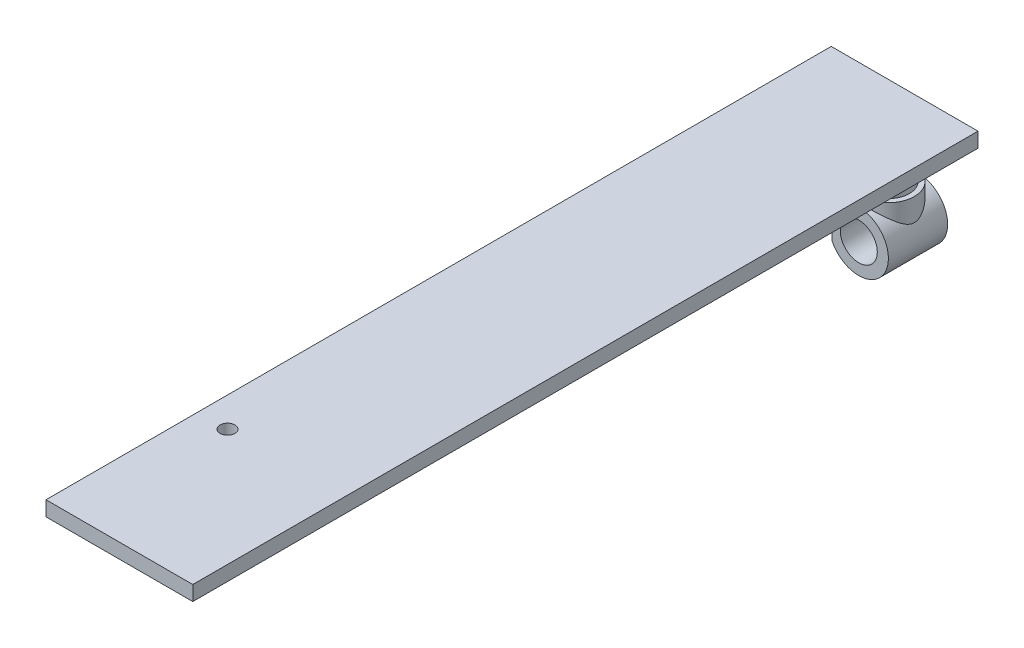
ISO-10303-21;
HEADER;
FILE_DESCRIPTION(('STEP AP214'),'2;1');
FILE_NAME('part.step','',(''),(''),'','','');
FILE_SCHEMA(('AUTOMOTIVE_DESIGN { 1 0 10303 214 1 1 1 1 }'));
ENDSEC;
DATA;
#1=APPLICATION_CONTEXT('core data for automotive mechanical design processes');
#2=APPLICATION_PROTOCOL_DEFINITION('international standard','automotive_design',2000,#1);
#3=PRODUCT_CONTEXT('',#1,'mechanical');
#4=PRODUCT('Part','Part','',(#3));
#5=PRODUCT_RELATED_PRODUCT_CATEGORY('part','',(#4));
#6=PRODUCT_DEFINITION_FORMATION('','',#4);
#7=PRODUCT_DEFINITION_CONTEXT('part definition',#1,'design');
#8=PRODUCT_DEFINITION('design','',#6,#7);
#9=PRODUCT_DEFINITION_SHAPE('','',#8);
#10=(LENGTH_UNIT() NAMED_UNIT(*) SI_UNIT(.MILLI.,.METRE.));
#11=(NAMED_UNIT(*) PLANE_ANGLE_UNIT() SI_UNIT($,.RADIAN.));
#12=(NAMED_UNIT(*) SI_UNIT($,.STERADIAN.) SOLID_ANGLE_UNIT());
#13=UNCERTAINTY_MEASURE_WITH_UNIT(LENGTH_MEASURE(1.E-05),#10,'distance_accuracy_value','');
#14=(GEOMETRIC_REPRESENTATION_CONTEXT(3) GLOBAL_UNCERTAINTY_ASSIGNED_CONTEXT((#13)) GLOBAL_UNIT_ASSIGNED_CONTEXT((#10,
#11,#12)) REPRESENTATION_CONTEXT('',''));
#15=CARTESIAN_POINT('',(0.,0.,0.));
#16=DIRECTION('',(0.,0.,1.));
#17=DIRECTION('',(1.,0.,0.));
#18=AXIS2_PLACEMENT_3D('',#15,#16,#17);
#19=CARTESIAN_POINT('',(0.,0.,20.));
#20=DIRECTION('',(0.,0.,1.));
#21=DIRECTION('',(1.,0.,0.));
#22=AXIS2_PLACEMENT_3D('',#19,#20,#21);
#23=PLANE('',#22);
#24=DIRECTION('',(0.,1.,0.));
#25=VECTOR('',#24,1.);
#26=CARTESIAN_POINT('',(-18.,10.,20.));
#27=LINE('',#26,#25);
#28=CARTESIAN_POINT('',(-18.,-8.71779788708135,20.));
#29=VERTEX_POINT('',#28);
#30=CARTESIAN_POINT('',(-18.,8.71779788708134,20.));
#31=VERTEX_POINT('',#30);
#32=EDGE_CURVE('E47',#29,#31,#27,.T.);
#33=ORIENTED_EDGE('',*,*,#32,.F.);
#34=CARTESIAN_POINT('',(0.,0.,20.));
#35=DIRECTION('',(0.,0.,1.));
#36=DIRECTION('',(1.,0.,0.));
#37=AXIS2_PLACEMENT_3D('',#34,#35,#36);
#38=CIRCLE('',#37,20.);
#39=EDGE_CURVE('E309',#29,#31,#38,.T.);
#40=ORIENTED_EDGE('',*,*,#39,.T.);
#41=EDGE_LOOP('',(#33,#40));
#42=FACE_BOUND('',#41,.T.);
#43=CARTESIAN_POINT('',(0.,0.,20.));
#44=DIRECTION('',(0.,0.,1.));
#45=DIRECTION('',(1.,0.,0.));
#46=AXIS2_PLACEMENT_3D('',#43,#44,#45);
#47=CIRCLE('',#46,12.5);
#48=CARTESIAN_POINT('',(12.5,0.,20.));
#49=VERTEX_POINT('',#48);
#50=EDGE_CURVE('E145',#49,#49,#47,.T.);
#51=ORIENTED_EDGE('',*,*,#50,.F.);
#52=EDGE_LOOP('',(#51));
#53=FACE_BOUND('',#52,.T.);
#54=ADVANCED_FACE('F32',(#42,#53),#23,.T.);
#55=CARTESIAN_POINT('',(0.,0.,-20.));
#56=DIRECTION('',(0.,0.,1.));
#57=DIRECTION('',(1.,0.,0.));
#58=AXIS2_PLACEMENT_3D('',#55,#56,#57);
#59=PLANE('',#58);
#60=CARTESIAN_POINT('',(0.,0.,-20.));
#61=DIRECTION('',(0.,0.,1.));
#62=DIRECTION('',(1.,0.,0.));
#63=AXIS2_PLACEMENT_3D('',#60,#61,#62);
#64=CIRCLE('',#63,20.);
#65=CARTESIAN_POINT('',(-18.,-8.71779788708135,-20.));
#66=VERTEX_POINT('',#65);
#67=CARTESIAN_POINT('',(-18.,8.71779788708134,-20.));
#68=VERTEX_POINT('',#67);
#69=EDGE_CURVE('E313',#66,#68,#64,.T.);
#70=ORIENTED_EDGE('',*,*,#69,.F.);
#71=DIRECTION('',(0.,1.,0.));
#72=VECTOR('',#71,1.);
#73=CARTESIAN_POINT('',(-18.,10.,-20.));
#74=LINE('',#73,#72);
#75=EDGE_CURVE('E131',#66,#68,#74,.T.);
#76=ORIENTED_EDGE('',*,*,#75,.T.);
#77=EDGE_LOOP('',(#70,#76));
#78=FACE_BOUND('',#77,.T.);
#79=CARTESIAN_POINT('',(0.,0.,-20.));
#80=DIRECTION('',(0.,0.,1.));
#81=DIRECTION('',(1.,0.,0.));
#82=AXIS2_PLACEMENT_3D('',#79,#80,#81);
#83=CIRCLE('',#82,12.5);
#84=CARTESIAN_POINT('',(12.5,0.,-20.));
#85=VERTEX_POINT('',#84);
#86=EDGE_CURVE('E144',#85,#85,#83,.T.);
#87=ORIENTED_EDGE('',*,*,#86,.T.);
#88=EDGE_LOOP('',(#87));
#89=FACE_BOUND('',#88,.T.);
#90=ADVANCED_FACE('F185',(#78,#89),#59,.F.);
#91=CARTESIAN_POINT('',(0.,0.,20.));
#92=DIRECTION('',(0.,0.,-1.));
#93=DIRECTION('',(-1.,0.,0.));
#94=AXIS2_PLACEMENT_3D('',#91,#92,#93);
#95=CYLINDRICAL_SURFACE('',#94,20.);
#96=CARTESIAN_POINT('',(0.,20.,17.5));
#97=CARTESIAN_POINT('',(0.409310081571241,20.0000043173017,17.5000043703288));
#98=CARTESIAN_POINT('',(0.81857181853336,19.9874130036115,17.4856188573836));
#99=CARTESIAN_POINT('',(1.63371360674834,19.9373449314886,17.428365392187));
#100=CARTESIAN_POINT('',(2.03959248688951,19.8998598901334,17.3854879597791));
#101=CARTESIAN_POINT('',(2.84495519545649,19.8007848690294,17.271995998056));
#102=CARTESIAN_POINT('',(3.24443051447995,19.739165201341,17.2013473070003));
#103=CARTESIAN_POINT('',(4.03348452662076,19.5931618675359,17.0336049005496));
#104=CARTESIAN_POINT('',(4.42306380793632,19.5087795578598,16.9365127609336));
#105=CARTESIAN_POINT('',(5.18734779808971,19.3195605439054,16.7182045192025));
#106=CARTESIAN_POINT('',(5.5621332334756,19.2148614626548,16.5971506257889));
#107=CARTESIAN_POINT('',(6.29757814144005,18.9865422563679,16.3322776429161));
#108=CARTESIAN_POINT('',(6.6582377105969,18.8629222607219,16.188458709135));
#109=CARTESIAN_POINT('',(7.36399894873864,18.5987498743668,15.8798571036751));
#110=CARTESIAN_POINT('',(7.70910095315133,18.4581978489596,15.715074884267));
#111=CARTESIAN_POINT('',(8.38281370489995,18.1621555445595,15.3662745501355));
#112=CARTESIAN_POINT('',(8.71142079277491,18.0066619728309,15.1822521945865));
#113=CARTESIAN_POINT('',(9.47545139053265,17.6199703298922,14.721904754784));
#114=CARTESIAN_POINT('',(9.90295999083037,17.3827741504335,14.4374321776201));
#115=CARTESIAN_POINT('',(10.7241338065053,16.8885404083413,13.8384055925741));
#116=CARTESIAN_POINT('',(11.1177867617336,16.6314957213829,13.5238407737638));
#117=CARTESIAN_POINT('',(11.8718925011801,16.101891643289,12.8669653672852));
#118=CARTESIAN_POINT('',(12.2322661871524,15.8292976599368,12.5245921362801));
#119=CARTESIAN_POINT('',(12.9189520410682,15.2740176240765,11.8150097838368));
#120=CARTESIAN_POINT('',(13.245268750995,14.9913329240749,11.4478039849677));
#121=CARTESIAN_POINT('',(13.8709259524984,14.4146539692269,10.6816356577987));
#122=CARTESIAN_POINT('',(14.1695316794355,14.1205473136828,10.2821585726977));
#123=CARTESIAN_POINT('',(14.7319137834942,13.532778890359,9.45882545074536));
#124=CARTESIAN_POINT('',(14.9956791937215,13.2391172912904,9.03496179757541));
#125=CARTESIAN_POINT('',(15.4875688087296,12.6601412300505,8.16304947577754));
#126=CARTESIAN_POINT('',(15.7157616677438,12.3748115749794,7.7150496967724));
#127=CARTESIAN_POINT('',(16.1360267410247,11.8215430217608,6.79231309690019));
#128=CARTESIAN_POINT('',(16.3281264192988,11.5535910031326,6.31759696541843));
#129=CARTESIAN_POINT('',(16.5900333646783,11.171205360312,5.5760316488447));
#130=CARTESIAN_POINT('',(16.6739706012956,11.0453363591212,5.32001317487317));
#131=CARTESIAN_POINT('',(16.8311299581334,10.8043372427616,4.79968230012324));
#132=CARTESIAN_POINT('',(16.9043516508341,10.6892075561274,4.53536956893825));
#133=CARTESIAN_POINT('',(17.03927411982,10.4727930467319,3.99869568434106));
#134=CARTESIAN_POINT('',(17.1009917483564,10.37148803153,3.72634699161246));
#135=CARTESIAN_POINT('',(17.2121601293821,10.1859341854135,3.17347969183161));
#136=CARTESIAN_POINT('',(17.2616155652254,10.1016788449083,2.89296424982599));
#137=CARTESIAN_POINT('',(17.3407113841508,9.96518782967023,2.36830260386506));
#138=CARTESIAN_POINT('',(17.3722302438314,9.91001953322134,2.1252065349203));
#139=CARTESIAN_POINT('',(17.425218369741,9.81655062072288,1.63478947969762));
#140=CARTESIAN_POINT('',(17.4466926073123,9.77824166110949,1.3874706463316));
#141=CARTESIAN_POINT('',(17.4791148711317,9.7201678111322,0.890241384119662));
#142=CARTESIAN_POINT('',(17.4900749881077,9.70038162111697,0.64033426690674));
#143=CARTESIAN_POINT('',(17.5012364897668,9.68023037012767,0.139486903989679));
#144=CARTESIAN_POINT('',(17.5014379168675,9.67986523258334,-0.11145333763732));
#145=CARTESIAN_POINT('',(17.4910766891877,9.69857437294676,-0.612370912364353));
#146=CARTESIAN_POINT('',(17.4805141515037,9.71764843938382,-0.862348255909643));
#147=CARTESIAN_POINT('',(17.448891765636,9.77431406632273,-1.35949833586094));
#148=CARTESIAN_POINT('',(17.427831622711,9.81190614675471,-1.60667099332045));
#149=CARTESIAN_POINT('',(17.3756436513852,9.90402925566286,-2.09712557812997));
#150=CARTESIAN_POINT('',(17.344500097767,9.95858673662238,-2.34040080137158));
#151=CARTESIAN_POINT('',(17.2727255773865,10.0825630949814,-2.82173892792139));
#152=CARTESIAN_POINT('',(17.2320912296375,10.1519872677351,-3.05979994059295));
#153=CARTESIAN_POINT('',(17.1147438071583,10.3491760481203,-3.6718974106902));
#154=CARTESIAN_POINT('',(17.0310468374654,10.4868834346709,-4.04140613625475));
#155=CARTESIAN_POINT('',(16.8429306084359,10.786425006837,-4.76504901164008));
#156=CARTESIAN_POINT('',(16.7384974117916,10.9482754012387,-5.11917262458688));
#157=CARTESIAN_POINT('',(16.5101165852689,11.2897476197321,-5.81378986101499));
#158=CARTESIAN_POINT('',(16.3861020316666,11.4694295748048,-6.1542315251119));
#159=CARTESIAN_POINT('',(16.1198996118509,11.8406510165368,-6.82112423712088));
#160=CARTESIAN_POINT('',(15.9777136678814,12.0321892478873,-7.14757675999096));
#161=CARTESIAN_POINT('',(15.7054064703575,12.3846537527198,-7.7247037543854));
#162=CARTESIAN_POINT('',(15.578385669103,12.5442188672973,-7.97768623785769));
#163=CARTESIAN_POINT('',(15.3131866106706,12.8666205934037,-8.47560407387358));
#164=CARTESIAN_POINT('',(15.1750072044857,13.0294575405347,-8.7205385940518));
#165=CARTESIAN_POINT('',(14.7437691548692,13.5207600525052,-9.44387555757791));
#166=CARTESIAN_POINT('',(14.4340769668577,13.8519299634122,-9.9106715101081));
#167=CARTESIAN_POINT('',(13.7709397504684,14.5113743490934,-10.8131561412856));
#168=CARTESIAN_POINT('',(13.4175392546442,14.8396514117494,-11.2488757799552));
#169=CARTESIAN_POINT('',(12.66635234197,15.4857603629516,-12.0884462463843));
#170=CARTESIAN_POINT('',(12.2685859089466,15.8035968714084,-12.4923112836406));
#171=CARTESIAN_POINT('',(11.5236983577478,16.3513589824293,-13.1775945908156));
#172=CARTESIAN_POINT('',(11.1855959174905,16.5848544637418,-13.4659887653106));
#173=CARTESIAN_POINT('',(10.4825372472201,17.0379355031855,-14.0202260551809));
#174=CARTESIAN_POINT('',(10.1175816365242,17.2575213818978,-14.2860696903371));
#175=CARTESIAN_POINT('',(9.36167408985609,17.6789723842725,-14.7924205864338));
#176=CARTESIAN_POINT('',(8.97075936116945,17.8808619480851,-15.0329628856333));
#177=CARTESIAN_POINT('',(8.16333251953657,18.2636105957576,-15.486258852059));
#178=CARTESIAN_POINT('',(7.74682568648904,18.4444739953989,-15.6990182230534));
#179=CARTESIAN_POINT('',(6.97073127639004,18.749625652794,-16.056318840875));
#180=CARTESIAN_POINT('',(6.61524010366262,18.8781487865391,-16.206156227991));
#181=CARTESIAN_POINT('',(5.88978506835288,19.1169080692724,-16.4836639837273));
#182=CARTESIAN_POINT('',(5.51982420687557,19.2271479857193,-16.6113389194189));
#183=CARTESIAN_POINT('',(4.7672696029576,19.4274209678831,-16.8427445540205));
#184=CARTESIAN_POINT('',(4.38468018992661,19.5174608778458,-16.9464833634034));
#185=CARTESIAN_POINT('',(3.60900842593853,19.6756627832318,-17.1284479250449));
#186=CARTESIAN_POINT('',(3.21592595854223,19.7438245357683,-17.20667339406));
#187=CARTESIAN_POINT('',(2.41987100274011,19.8571577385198,-17.3366008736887));
#188=CARTESIAN_POINT('',(2.016856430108,19.9022024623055,-17.3881566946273));
#189=CARTESIAN_POINT('',(1.20621871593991,19.9677334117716,-17.4631242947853));
#190=CARTESIAN_POINT('',(0.798595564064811,19.988219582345,-17.4865360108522));
#191=CARTESIAN_POINT('',(-0.0177076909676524,20.0041573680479,-17.5047516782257));
#192=CARTESIAN_POINT('',(-0.426387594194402,19.9996134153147,-17.4995606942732));
#193=CARTESIAN_POINT('',(-1.24132609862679,19.9656056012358,-17.4606843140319));
#194=CARTESIAN_POINT('',(-1.64758483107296,19.9361431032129,-17.4270004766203));
#195=CARTESIAN_POINT('',(-2.41934317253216,19.8565863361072,-17.3359298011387));
#196=CARTESIAN_POINT('',(-2.7853269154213,19.8084987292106,-17.2808471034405));
#197=CARTESIAN_POINT('',(-3.51008378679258,19.6929924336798,-17.1483237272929));
#198=CARTESIAN_POINT('',(-3.8688574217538,19.6255751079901,-17.070884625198));
#199=CARTESIAN_POINT('',(-4.57722430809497,19.4725540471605,-16.8947406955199));
#200=CARTESIAN_POINT('',(-4.92681597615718,19.3869471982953,-16.7960322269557));
#201=CARTESIAN_POINT('',(-5.61507990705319,19.1989107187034,-16.5786352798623));
#202=CARTESIAN_POINT('',(-5.95375149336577,19.0964800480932,-16.4599455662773));
#203=CARTESIAN_POINT('',(-6.64099831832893,18.8689360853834,-16.1954191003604));
#204=CARTESIAN_POINT('',(-6.98872904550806,18.7427659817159,-16.0483002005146));
#205=CARTESIAN_POINT('',(-7.66901492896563,18.4748446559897,-15.7345653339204));
#206=CARTESIAN_POINT('',(-8.00156984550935,18.3330931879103,-15.5679490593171));
#207=CARTESIAN_POINT('',(-8.65064537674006,18.0359008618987,-15.2168479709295));
#208=CARTESIAN_POINT('',(-8.96716818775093,17.8804618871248,-15.032365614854));
#209=CARTESIAN_POINT('',(-9.58375657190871,17.5576982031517,-14.6469738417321));
#210=CARTESIAN_POINT('',(-9.88381872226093,17.3903710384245,-14.4460610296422));
#211=CARTESIAN_POINT('',(-10.6172602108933,16.9569151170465,-13.9218746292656));
#212=CARTESIAN_POINT('',(-11.0398316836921,16.6842336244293,-13.588815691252));
#213=CARTESIAN_POINT('',(-11.8463443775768,16.1216034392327,-12.8917988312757));
#214=CARTESIAN_POINT('',(-12.2302679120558,15.8316469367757,-12.5278269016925));
#215=CARTESIAN_POINT('',(-12.9614454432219,15.2388790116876,-11.7698599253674));
#216=CARTESIAN_POINT('',(-13.3085076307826,14.936010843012,-11.3757246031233));
#217=CARTESIAN_POINT('',(-13.9640591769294,14.3250058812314,-10.5607085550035));
#218=CARTESIAN_POINT('',(-14.27255791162,14.0168703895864,-10.1398343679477));
#219=CARTESIAN_POINT('',(-14.8580392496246,13.3949589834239,-9.26141456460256));
#220=CARTESIAN_POINT('',(-15.134130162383,13.0812170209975,-8.80324677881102));
#221=CARTESIAN_POINT('',(-15.5179948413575,12.6187236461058,-8.09407620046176));
#222=CARTESIAN_POINT('',(-15.6409672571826,12.4658257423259,-7.85388652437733));
#223=CARTESIAN_POINT('',(-15.876607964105,12.1642869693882,-7.36591807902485));
#224=CARTESIAN_POINT('',(-15.989277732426,12.0156454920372,-7.11814040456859));
#225=CARTESIAN_POINT('',(-16.2033681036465,11.7253223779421,-6.61625282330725));
#226=CARTESIAN_POINT('',(-16.3048577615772,11.5836014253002,-6.3621952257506));
#227=CARTESIAN_POINT('',(-16.4970763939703,11.3081681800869,-5.84571678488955));
#228=CARTESIAN_POINT('',(-16.5878039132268,11.1744569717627,-5.58329481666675));
#229=CARTESIAN_POINT('',(-16.7577981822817,10.9178679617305,-5.05018162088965));
#230=CARTESIAN_POINT('',(-16.8370854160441,10.7949709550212,-4.77950625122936));
#231=CARTESIAN_POINT('',(-16.9836515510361,10.5628789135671,-4.22925343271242));
#232=CARTESIAN_POINT('',(-17.050935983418,10.4536775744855,-3.94968015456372));
#233=CARTESIAN_POINT('',(-17.1642334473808,10.266419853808,-3.42078724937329));
#234=CARTESIAN_POINT('',(-17.2119003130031,10.1861451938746,-3.17261240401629));
#235=CARTESIAN_POINT('',(-17.2969865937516,10.0409832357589,-2.67005175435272));
#236=CARTESIAN_POINT('',(-17.3344071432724,9.97609423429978,-2.41566664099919));
#237=CARTESIAN_POINT('',(-17.3982168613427,9.8643903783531,-1.90229936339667));
#238=CARTESIAN_POINT('',(-17.4246365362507,9.81752556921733,-1.64333201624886));
#239=CARTESIAN_POINT('',(-17.465978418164,9.74378798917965,-1.12162514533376));
#240=CARTESIAN_POINT('',(-17.4809010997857,9.71691439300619,-0.858885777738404));
#241=CARTESIAN_POINT('',(-17.4989072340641,9.68445177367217,-0.329816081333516));
#242=CARTESIAN_POINT('',(-17.5019069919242,9.67901321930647,-0.0634734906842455));
#243=CARTESIAN_POINT('',(-17.49574827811,9.69014075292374,0.468597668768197));
#244=CARTESIAN_POINT('',(-17.4865899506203,9.70670657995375,0.734326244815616));
#245=CARTESIAN_POINT('',(-17.4563498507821,9.76098352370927,1.26341206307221));
#246=CARTESIAN_POINT('',(-17.4352452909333,9.79873505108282,1.52676379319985));
#247=CARTESIAN_POINT('',(-17.381640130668,9.89350935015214,2.04877666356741));
#248=CARTESIAN_POINT('',(-17.3491375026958,9.9505355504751,2.30743696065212));
#249=CARTESIAN_POINT('',(-17.2608372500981,10.1031491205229,2.90380191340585));
#250=CARTESIAN_POINT('',(-17.2008879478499,10.2052532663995,3.23922196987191));
#251=CARTESIAN_POINT('',(-17.0636267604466,10.4331340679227,3.89821678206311));
#252=CARTESIAN_POINT('',(-16.9863071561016,10.5589212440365,4.22178619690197));
#253=CARTESIAN_POINT('',(-16.8154820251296,10.8289035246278,4.85780900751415));
#254=CARTESIAN_POINT('',(-16.721930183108,10.9731509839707,5.17022742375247));
#255=CARTESIAN_POINT('',(-16.5198679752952,11.275059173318,5.78344114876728));
#256=CARTESIAN_POINT('',(-16.4113578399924,11.4327196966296,6.08423663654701));
#257=CARTESIAN_POINT('',(-16.1958343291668,11.7356153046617,6.63476020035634));
#258=CARTESIAN_POINT('',(-16.0906207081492,11.8796281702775,6.88587397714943));
#259=CARTESIAN_POINT('',(-15.8698848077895,12.1729410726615,7.38038296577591));
#260=CARTESIAN_POINT('',(-15.7543610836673,12.322241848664,7.62377708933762));
#261=CARTESIAN_POINT('',(-15.3925479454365,12.7757095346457,8.3431402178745));
#262=CARTESIAN_POINT('',(-15.1310806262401,13.0853499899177,8.80812760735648));
#263=CARTESIAN_POINT('',(-14.5681708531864,13.709322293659,9.71090211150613));
#264=CARTESIAN_POINT('',(-14.2666741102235,14.0236599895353,10.1486510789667));
#265=CARTESIAN_POINT('',(-13.623933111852,14.648870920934,10.9964199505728));
#266=CARTESIAN_POINT('',(-13.2826986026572,14.9597449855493,11.4064466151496));
#267=CARTESIAN_POINT('',(-12.5471109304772,15.5823772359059,12.211794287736));
#268=CARTESIAN_POINT('',(-12.1512960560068,15.8937705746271,12.6060673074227));
#269=CARTESIAN_POINT('',(-11.3160065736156,16.498909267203,13.3609445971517));
#270=CARTESIAN_POINT('',(-10.8765215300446,16.792650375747,13.7215407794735));
#271=CARTESIAN_POINT('',(-9.95549048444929,17.354491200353,14.4036663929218));
#272=CARTESIAN_POINT('',(-9.47407718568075,17.6226665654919,14.7253118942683));
#273=CARTESIAN_POINT('',(-8.46936230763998,18.1269205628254,15.3251952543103));
#274=CARTESIAN_POINT('',(-7.94609165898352,18.3630225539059,15.6034647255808));
#275=CARTESIAN_POINT('',(-7.05828187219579,18.7168072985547,16.0179860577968));
#276=CARTESIAN_POINT('',(-6.70528556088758,18.846314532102,16.1690655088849));
#277=CARTESIAN_POINT('',(-5.98474515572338,19.0873528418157,16.4493820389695));
#278=CARTESIAN_POINT('',(-5.61720280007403,19.1988860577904,16.578621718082));
#279=CARTESIAN_POINT('',(-4.86992231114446,19.4018938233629,16.8132965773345));
#280=CARTESIAN_POINT('',(-4.4902067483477,19.4934032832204,16.9187731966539));
#281=CARTESIAN_POINT('',(-3.72029279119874,19.6548750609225,17.1045672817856));
#282=CARTESIAN_POINT('',(-3.33009745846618,19.7248435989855,17.1848920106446));
#283=CARTESIAN_POINT('',(-2.45471186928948,19.8547424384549,17.3338520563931));
#284=CARTESIAN_POINT('',(-1.9675512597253,19.9090549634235,17.3960016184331));
#285=CARTESIAN_POINT('',(-0.986904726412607,19.9816856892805,17.4790781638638));
#286=CARTESIAN_POINT('',(-0.493417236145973,19.9999947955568,17.4999947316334));
#287=CARTESIAN_POINT('',(0.,20.,17.5));
#288=B_SPLINE_CURVE_WITH_KNOTS('',3,(#96,#97,#98,#99,#100,#101,#102,#103,#104,#105,#106,#107,
#108,#109,#110,#111,#112,#113,#114,#115,#116,#117,#118,#119,#120,#121,#122,#123,#124,#125,#126,
#127,#128,#129,#130,#131,#132,#133,#134,#135,#136,#137,#138,#139,#140,#141,#142,#143,#144,#145,
#146,#147,#148,#149,#150,#151,#152,#153,#154,#155,#156,#157,#158,#159,#160,#161,#162,#163,#164,
#165,#166,#167,#168,#169,#170,#171,#172,#173,#174,#175,#176,#177,#178,#179,#180,#181,#182,#183,
#184,#185,#186,#187,#188,#189,#190,#191,#192,#193,#194,#195,#196,#197,#198,#199,#200,#201,#202,
#203,#204,#205,#206,#207,#208,#209,#210,#211,#212,#213,#214,#215,#216,#217,#218,#219,#220,#221,
#222,#223,#224,#225,#226,#227,#228,#229,#230,#231,#232,#233,#234,#235,#236,#237,#238,#239,#240,
#241,#242,#243,#244,#245,#246,#247,#248,#249,#250,#251,#252,#253,#254,#255,#256,#257,#258,#259,
#260,#261,#262,#263,#264,#265,#266,#267,#268,#269,#270,#271,#272,#273,#274,#275,#276,#277,#278,
#279,#280,#281,#282,#283,#284,#285,#286,#287),.UNSPECIFIED.,.T.,.F.,(4,2,2,2,2,2,2,2,2,2,2,2,2,
2,2,2,2,2,2,2,2,2,2,2,2,2,2,2,2,2,2,2,2,2,2,2,2,2,2,2,2,2,2,2,2,2,2,2,2,2,2,2,2,2,2,2,2,2,2,2,2,
2,2,2,2,2,2,2,2,2,2,2,2,2,2,2,2,2,2,2,2,2,2,2,2,2,2,2,2,2,2,2,2,2,2,4),(0.,1.2274053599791,
2.45521932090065,3.68454838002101,4.91380419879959,6.13500687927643,7.35620120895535,
8.57736919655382,9.79880691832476,11.4932530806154,13.1883102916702,14.8872978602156,
16.5860585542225,18.3215055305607,20.057497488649,21.7900963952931,23.5213715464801,
24.4131079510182,25.3048799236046,26.1953350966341,27.0854496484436,27.8385169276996,
28.5912110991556,29.3430386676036,30.0948632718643,30.8466796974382,31.5985172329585,
32.3515329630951,33.1048173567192,34.3121317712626,35.5202604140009,36.732611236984,
37.9448339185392,38.9193800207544,39.8940266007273,41.8438512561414,43.7917054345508,
45.7386857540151,47.2434221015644,48.7481237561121,50.250713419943,51.7529941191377,
52.9717012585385,54.1901569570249,55.4081991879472,56.6262549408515,57.850918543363,
59.0755848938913,60.3000343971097,61.5244169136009,62.6428157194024,63.761135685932,
64.8796472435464,65.9982279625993,67.1913663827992,68.3845236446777,69.5775170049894,
70.7707575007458,72.5777163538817,74.385498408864,76.2022686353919,78.0185962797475,
79.8768433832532,80.8070514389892,81.7371259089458,82.6610887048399,83.5851762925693,
84.5075881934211,85.4295739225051,86.2244123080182,87.0191626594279,87.8116941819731,
88.6041929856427,89.4022451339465,90.2002878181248,90.9998579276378,91.7995703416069,
92.8649317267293,93.9307674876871,94.9996959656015,96.068607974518,96.9922887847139,
97.9160992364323,99.7643098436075,101.615053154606,103.465343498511,105.381706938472,
107.298529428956,109.209491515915,111.119054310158,112.333623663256,113.54804831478,
114.76033851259,115.972278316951,117.451523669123,118.931142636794),.UNSPECIFIED.);
#289=CARTESIAN_POINT('',(0.,20.,17.5));
#290=VERTEX_POINT('',#289);
#291=EDGE_CURVE('E137',#290,#290,#288,.T.);
#292=ORIENTED_EDGE('',*,*,#291,.F.);
#293=EDGE_LOOP('',(#292));
#294=FACE_BOUND('',#293,.T.);
#295=ORIENTED_EDGE('',*,*,#39,.F.);
#296=DIRECTION('',(0.,0.,-1.));
#297=VECTOR('',#296,1.);
#298=CARTESIAN_POINT('',(-18.,-8.71779788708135,20.));
#299=LINE('',#298,#297);
#300=EDGE_CURVE('E40',#29,#66,#299,.T.);
#301=ORIENTED_EDGE('',*,*,#300,.T.);
#302=ORIENTED_EDGE('',*,*,#69,.T.);
#303=DIRECTION('',(0.,0.,-1.));
#304=VECTOR('',#303,1.);
#305=CARTESIAN_POINT('',(-18.,8.71779788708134,20.));
#306=LINE('',#305,#304);
#307=EDGE_CURVE('E51',#68,#31,#306,.F.);
#308=ORIENTED_EDGE('',*,*,#307,.T.);
#309=EDGE_LOOP('',(#295,#301,#302,#308));
#310=FACE_BOUND('',#309,.T.);
#311=ADVANCED_FACE('F34',(#294,#310),#95,.T.);
#312=CARTESIAN_POINT('',(0.,0.,20.));
#313=DIRECTION('',(0.,0.,-1.));
#314=DIRECTION('',(-1.,0.,0.));
#315=AXIS2_PLACEMENT_3D('',#312,#313,#314);
#316=CYLINDRICAL_SURFACE('',#315,12.5);
#317=ORIENTED_EDGE('',*,*,#50,.T.);
#318=EDGE_LOOP('',(#317));
#319=FACE_BOUND('',#318,.T.);
#320=ORIENTED_EDGE('',*,*,#86,.F.);
#321=EDGE_LOOP('',(#320));
#322=FACE_BOUND('',#321,.T.);
#323=ADVANCED_FACE('F155',(#319,#322),#316,.F.);
#324=CARTESIAN_POINT('',(0.,25.,0.));
#325=DIRECTION('',(0.,1.,0.));
#326=DIRECTION('',(0.,0.,1.));
#327=AXIS2_PLACEMENT_3D('',#324,#325,#326);
#328=PLANE('',#327);
#329=CARTESIAN_POINT('',(0.,25.,0.));
#330=DIRECTION('',(0.,1.,0.));
#331=DIRECTION('',(0.,0.,1.));
#332=AXIS2_PLACEMENT_3D('',#329,#330,#331);
#333=CIRCLE('',#332,14.142135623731);
#334=CARTESIAN_POINT('',(0.,25.,14.142135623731));
#335=VERTEX_POINT('',#334);
#336=EDGE_CURVE('E312',#335,#335,#333,.F.);
#337=ORIENTED_EDGE('',*,*,#336,.T.);
#338=EDGE_LOOP('',(#337));
#339=FACE_BOUND('',#338,.T.);
#340=CARTESIAN_POINT('',(0.,25.,0.));
#341=DIRECTION('',(0.,1.,0.));
#342=DIRECTION('',(0.,0.,1.));
#343=AXIS2_PLACEMENT_3D('',#340,#341,#342);
#344=CIRCLE('',#343,17.5);
#345=CARTESIAN_POINT('',(0.,25.,17.5));
#346=VERTEX_POINT('',#345);
#347=EDGE_CURVE('E133',#346,#346,#344,.T.);
#348=ORIENTED_EDGE('',*,*,#347,.T.);
#349=EDGE_LOOP('',(#348));
#350=FACE_BOUND('',#349,.T.);
#351=ADVANCED_FACE('F152',(#339,#350),#328,.T.);
#352=CARTESIAN_POINT('',(0.,-20.001,0.));
#353=DIRECTION('',(0.,1.,0.));
#354=DIRECTION('',(0.,0.,1.));
#355=AXIS2_PLACEMENT_3D('',#352,#353,#354);
#356=CYLINDRICAL_SURFACE('',#355,17.5);
#357=ORIENTED_EDGE('',*,*,#347,.F.);
#358=EDGE_LOOP('',(#357));
#359=FACE_BOUND('',#358,.T.);
#360=ORIENTED_EDGE('',*,*,#291,.T.);
#361=EDGE_LOOP('',(#360));
#362=FACE_BOUND('',#361,.T.);
#363=ADVANCED_FACE('F147',(#359,#362),#356,.T.);
#364=CARTESIAN_POINT('',(0.,-20.001,0.));
#365=DIRECTION('',(0.,1.,0.));
#366=DIRECTION('',(0.,0.,1.));
#367=AXIS2_PLACEMENT_3D('',#364,#365,#366);
#368=CYLINDRICAL_SURFACE('',#367,14.142135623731);
#369=CARTESIAN_POINT('',(0.,45.,0.));
#370=DIRECTION('',(0.,-1.,0.));
#371=DIRECTION('',(0.,0.,-1.));
#372=AXIS2_PLACEMENT_3D('',#369,#370,#371);
#373=CIRCLE('',#372,14.142135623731);
#374=CARTESIAN_POINT('',(0.,45.,-14.142135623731));
#375=VERTEX_POINT('',#374);
#376=EDGE_CURVE('E11',#375,#375,#373,.F.);
#377=ORIENTED_EDGE('',*,*,#376,.F.);
#378=EDGE_LOOP('',(#377));
#379=FACE_BOUND('',#378,.T.);
#380=ORIENTED_EDGE('',*,*,#336,.F.);
#381=EDGE_LOOP('',(#380));
#382=FACE_BOUND('',#381,.T.);
#383=ADVANCED_FACE('F161',(#379,#382),#368,.T.);
#384=CARTESIAN_POINT('',(-18.,10.,-20.));
#385=DIRECTION('',(1.,0.,0.));
#386=DIRECTION('',(0.,1.,0.));
#387=AXIS2_PLACEMENT_3D('',#384,#385,#386);
#388=PLANE('',#387);
#389=ORIENTED_EDGE('',*,*,#32,.T.);
#390=ORIENTED_EDGE('',*,*,#307,.F.);
#391=ORIENTED_EDGE('',*,*,#75,.F.);
#392=ORIENTED_EDGE('',*,*,#300,.F.);
#393=EDGE_LOOP('',(#389,#390,#391,#392));
#394=FACE_BOUND('',#393,.T.);
#395=ADVANCED_FACE('F157',(#394),#388,.F.);
#396=CARTESIAN_POINT('',(30.7914319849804,45.,-29.6868066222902));
#397=DIRECTION('',(1.,0.,0.));
#398=DIRECTION('',(0.,0.,-1.));
#399=AXIS2_PLACEMENT_3D('',#396,#397,#398);
#400=PLANE('',#399);
#401=DIRECTION('',(0.,0.,-1.));
#402=VECTOR('',#401,1.);
#403=CARTESIAN_POINT('',(30.7914319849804,55.,-29.6868066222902));
#404=LINE('',#403,#402);
#405=CARTESIAN_POINT('',(30.7914319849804,55.,500.31319337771));
#406=VERTEX_POINT('',#405);
#407=CARTESIAN_POINT('',(30.7914319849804,55.,-29.6868066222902));
#408=VERTEX_POINT('',#407);
#409=EDGE_CURVE('E119',#406,#408,#404,.T.);
#410=ORIENTED_EDGE('',*,*,#409,.F.);
#411=DIRECTION('',(0.,1.,0.));
#412=VECTOR('',#411,1.);
#413=CARTESIAN_POINT('',(30.7914319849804,55.,500.31319337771));
#414=LINE('',#413,#412);
#415=CARTESIAN_POINT('',(30.7914319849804,45.,500.31319337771));
#416=VERTEX_POINT('',#415);
#417=EDGE_CURVE('E104',#416,#406,#414,.T.);
#418=ORIENTED_EDGE('',*,*,#417,.F.);
#419=DIRECTION('',(0.,0.,-1.));
#420=VECTOR('',#419,1.);
#421=CARTESIAN_POINT('',(30.7914319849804,45.,-29.6868066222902));
#422=LINE('',#421,#420);
#423=CARTESIAN_POINT('',(30.7914319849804,45.,-29.6868066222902));
#424=VERTEX_POINT('',#423);
#425=EDGE_CURVE('E100',#416,#424,#422,.T.);
#426=ORIENTED_EDGE('',*,*,#425,.T.);
#427=DIRECTION('',(0.,1.,0.));
#428=VECTOR('',#427,1.);
#429=CARTESIAN_POINT('',(30.7914319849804,45.,-29.6868066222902));
#430=LINE('',#429,#428);
#431=EDGE_CURVE('E93',#424,#408,#430,.T.);
#432=ORIENTED_EDGE('',*,*,#431,.T.);
#433=EDGE_LOOP('',(#410,#418,#426,#432));
#434=FACE_BOUND('',#433,.T.);
#435=ADVANCED_FACE('F160',(#434),#400,.T.);
#436=CARTESIAN_POINT('',(-68.2784755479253,45.,-29.6868066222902));
#437=DIRECTION('',(-1.,0.,0.));
#438=DIRECTION('',(0.,0.,1.));
#439=AXIS2_PLACEMENT_3D('',#436,#437,#438);
#440=PLANE('',#439);
#441=DIRECTION('',(0.,0.,1.));
#442=VECTOR('',#441,1.);
#443=CARTESIAN_POINT('',(-68.2784755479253,55.,-29.6868066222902));
#444=LINE('',#443,#442);
#445=CARTESIAN_POINT('',(-68.2784755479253,55.,-29.6868066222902));
#446=VERTEX_POINT('',#445);
#447=CARTESIAN_POINT('',(-68.2784755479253,55.,500.31319337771));
#448=VERTEX_POINT('',#447);
#449=EDGE_CURVE('E121',#446,#448,#444,.T.);
#450=ORIENTED_EDGE('',*,*,#449,.F.);
#451=DIRECTION('',(0.,1.,0.));
#452=VECTOR('',#451,1.);
#453=CARTESIAN_POINT('',(-68.2784755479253,45.,-29.6868066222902));
#454=LINE('',#453,#452);
#455=CARTESIAN_POINT('',(-68.2784755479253,45.,-29.6868066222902));
#456=VERTEX_POINT('',#455);
#457=EDGE_CURVE('E89',#456,#446,#454,.T.);
#458=ORIENTED_EDGE('',*,*,#457,.F.);
#459=DIRECTION('',(0.,0.,1.));
#460=VECTOR('',#459,1.);
#461=CARTESIAN_POINT('',(-68.2784755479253,45.,-29.6868066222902));
#462=LINE('',#461,#460);
#463=CARTESIAN_POINT('',(-68.2784755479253,45.,500.31319337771));
#464=VERTEX_POINT('',#463);
#465=EDGE_CURVE('E83',#456,#464,#462,.T.);
#466=ORIENTED_EDGE('',*,*,#465,.T.);
#467=DIRECTION('',(0.,-1.,0.));
#468=VECTOR('',#467,1.);
#469=CARTESIAN_POINT('',(-68.2784755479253,55.,500.31319337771));
#470=LINE('',#469,#468);
#471=EDGE_CURVE('E88',#448,#464,#470,.T.);
#472=ORIENTED_EDGE('',*,*,#471,.F.);
#473=EDGE_LOOP('',(#450,#458,#466,#472));
#474=FACE_BOUND('',#473,.T.);
#475=ADVANCED_FACE('F86',(#474),#440,.T.);
#476=CARTESIAN_POINT('',(30.7914319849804,45.,-29.6868066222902));
#477=DIRECTION('',(0.,0.,-1.));
#478=DIRECTION('',(-1.,0.,0.));
#479=AXIS2_PLACEMENT_3D('',#476,#477,#478);
#480=PLANE('',#479);
#481=DIRECTION('',(-1.,0.,0.));
#482=VECTOR('',#481,1.);
#483=CARTESIAN_POINT('',(30.7914319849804,55.,-29.6868066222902));
#484=LINE('',#483,#482);
#485=EDGE_CURVE('E125',#408,#446,#484,.T.);
#486=ORIENTED_EDGE('',*,*,#485,.F.);
#487=ORIENTED_EDGE('',*,*,#431,.F.);
#488=DIRECTION('',(-1.,0.,0.));
#489=VECTOR('',#488,1.);
#490=CARTESIAN_POINT('',(30.7914319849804,45.,-29.6868066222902));
#491=LINE('',#490,#489);
#492=EDGE_CURVE('E94',#424,#456,#491,.T.);
#493=ORIENTED_EDGE('',*,*,#492,.T.);
#494=ORIENTED_EDGE('',*,*,#457,.T.);
#495=EDGE_LOOP('',(#486,#487,#493,#494));
#496=FACE_BOUND('',#495,.T.);
#497=ADVANCED_FACE('F165',(#496),#480,.T.);
#498=CARTESIAN_POINT('',(30.7914319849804,45.,370.31319337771));
#499=DIRECTION('',(0.,-1.,0.));
#500=DIRECTION('',(0.,0.,-1.));
#501=AXIS2_PLACEMENT_3D('',#498,#499,#500);
#502=PLANE('',#501);
#503=CARTESIAN_POINT('',(-48.2784755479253,45.,397.806357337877));
#504=DIRECTION('',(0.,-1.,0.));
#505=DIRECTION('',(0.,0.,-1.));
#506=AXIS2_PLACEMENT_3D('',#503,#504,#505);
#507=CIRCLE('',#506,5.00000000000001);
#508=CARTESIAN_POINT('',(-48.2784755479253,45.,392.806357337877));
#509=VERTEX_POINT('',#508);
#510=EDGE_CURVE('E113',#509,#509,#507,.T.);
#511=ORIENTED_EDGE('',*,*,#510,.F.);
#512=EDGE_LOOP('',(#511));
#513=FACE_BOUND('',#512,.T.);
#514=ORIENTED_EDGE('',*,*,#376,.T.);
#515=EDGE_LOOP('',(#514));
#516=FACE_BOUND('',#515,.T.);
#517=ORIENTED_EDGE('',*,*,#425,.F.);
#518=DIRECTION('',(1.,0.,0.));
#519=VECTOR('',#518,1.);
#520=CARTESIAN_POINT('',(-68.2784755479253,45.,500.31319337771));
#521=LINE('',#520,#519);
#522=EDGE_CURVE('E97',#464,#416,#521,.T.);
#523=ORIENTED_EDGE('',*,*,#522,.F.);
#524=ORIENTED_EDGE('',*,*,#465,.F.);
#525=ORIENTED_EDGE('',*,*,#492,.F.);
#526=EDGE_LOOP('',(#517,#523,#524,#525));
#527=FACE_BOUND('',#526,.T.);
#528=ADVANCED_FACE('F98',(#513,#516,#527),#502,.T.);
#529=CARTESIAN_POINT('',(0.,55.,0.));
#530=DIRECTION('',(0.,1.,0.));
#531=DIRECTION('',(0.,0.,1.));
#532=AXIS2_PLACEMENT_3D('',#529,#530,#531);
#533=PLANE('',#532);
#534=CARTESIAN_POINT('',(-48.2784755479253,55.,397.806357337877));
#535=DIRECTION('',(0.,-1.,0.));
#536=DIRECTION('',(0.,0.,-1.));
#537=AXIS2_PLACEMENT_3D('',#534,#535,#536);
#538=CIRCLE('',#537,5.00000000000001);
#539=CARTESIAN_POINT('',(-48.2784755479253,55.,392.806357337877));
#540=VERTEX_POINT('',#539);
#541=EDGE_CURVE('E110',#540,#540,#538,.T.);
#542=ORIENTED_EDGE('',*,*,#541,.T.);
#543=EDGE_LOOP('',(#542));
#544=FACE_BOUND('',#543,.T.);
#545=ORIENTED_EDGE('',*,*,#409,.T.);
#546=ORIENTED_EDGE('',*,*,#485,.T.);
#547=ORIENTED_EDGE('',*,*,#449,.T.);
#548=DIRECTION('',(-1.,0.,0.));
#549=VECTOR('',#548,1.);
#550=CARTESIAN_POINT('',(-68.2784755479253,55.,500.31319337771));
#551=LINE('',#550,#549);
#552=EDGE_CURVE('E109',#406,#448,#551,.T.);
#553=ORIENTED_EDGE('',*,*,#552,.F.);
#554=EDGE_LOOP('',(#545,#546,#547,#553));
#555=FACE_BOUND('',#554,.T.);
#556=ADVANCED_FACE('F173',(#544,#555),#533,.T.);
#557=CARTESIAN_POINT('',(0.,0.,500.31319337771));
#558=DIRECTION('',(0.,0.,1.));
#559=DIRECTION('',(1.,0.,0.));
#560=AXIS2_PLACEMENT_3D('',#557,#558,#559);
#561=PLANE('',#560);
#562=ORIENTED_EDGE('',*,*,#471,.T.);
#563=ORIENTED_EDGE('',*,*,#522,.T.);
#564=ORIENTED_EDGE('',*,*,#417,.T.);
#565=ORIENTED_EDGE('',*,*,#552,.T.);
#566=EDGE_LOOP('',(#562,#563,#564,#565));
#567=FACE_BOUND('',#566,.T.);
#568=ADVANCED_FACE('F107',(#567),#561,.T.);
#569=CARTESIAN_POINT('',(-48.2784755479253,55.,397.806357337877));
#570=DIRECTION('',(0.,-1.,0.));
#571=DIRECTION('',(0.,0.,-1.));
#572=AXIS2_PLACEMENT_3D('',#569,#570,#571);
#573=CYLINDRICAL_SURFACE('',#572,5.00000000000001);
#574=ORIENTED_EDGE('',*,*,#541,.F.);
#575=EDGE_LOOP('',(#574));
#576=FACE_BOUND('',#575,.T.);
#577=ORIENTED_EDGE('',*,*,#510,.T.);
#578=EDGE_LOOP('',(#577));
#579=FACE_BOUND('',#578,.T.);
#580=ADVANCED_FACE('F177',(#576,#579),#573,.F.);
#581=CLOSED_SHELL('',(#54,#90,#311,#323,#351,#363,#383,#395,#435,#475,#497,#528,#556,#568,#580));
#582=MANIFOLD_SOLID_BREP('B2',#581);
#583=ADVANCED_BREP_SHAPE_REPRESENTATION('',(#18,#582),#14);
#584=SHAPE_DEFINITION_REPRESENTATION(#9,#583);
ENDSEC;
END-ISO-10303-21;
